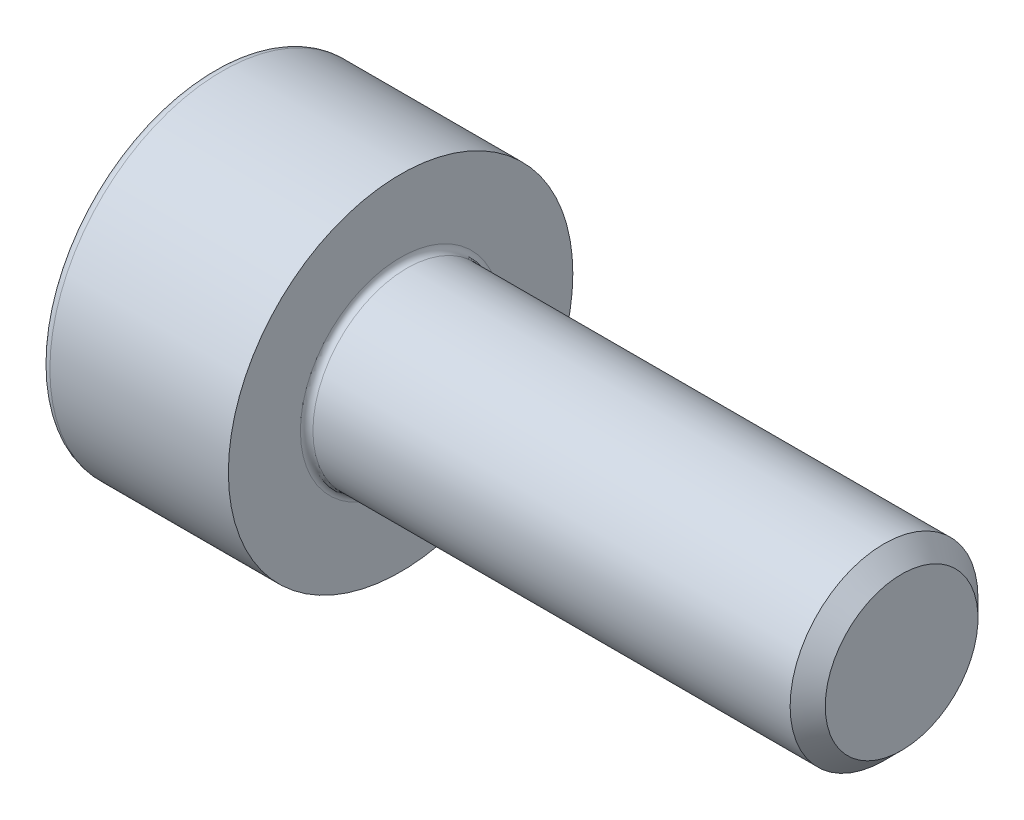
from build123d import *

# Parameters (mm, degrees)
FILLET1_R   = 0.1
FILLET2_R   = 0.15
HEX_2_DEPTH = 1.3


with BuildPart() as part:
    # BodySke → Base-Revolve (revolve)
    with BuildSketch(Plane.XY, mode=Mode.PRIVATE) as base_revolve_sk:
        Polygon((0, 0), (0, 2.75), (3, 2.75), (3, 1.5), (10.7195, 1.5), (11, 1.2195), (11, 0), align=None)
    revolve(base_revolve_sk.sketch.rotate(Axis((-31.75, 0, 0), (1, 0, 0)), 90), axis=Axis((-31.75, 0, 0), (1, 0, 0)))

    # Fillet1
    fillet1_edges = [part.edges().sort_by_distance(p)[0] for p in [
        (3, 0, -1.5),
    ]]
    fillet(fillet1_edges, radius=FILLET1_R)

    # Fillet2
    fillet2_edges = [part.edges().sort_by_distance(p)[0] for p in [
        (0, 0, -2.75),
    ]]
    fillet(fillet2_edges, radius=FILLET2_R)

    # Sketch2 → Hex-PreBroach (revolve, cut)
    with BuildSketch(Plane.XY, mode=Mode.PRIVATE) as hex_prebroach_sk:
        Polygon((0, 1.28), (1.3, 1.28), (2.039008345, 0), (0, 0), align=None)
    revolve(hex_prebroach_sk.sketch.rotate(Axis((0, 0, 0), (1, 0, 0)), 90), axis=Axis((0, 0, 0), (1, 0, 0)), mode=Mode.SUBTRACT)

    # Sketch3 → Hex 2 (cut)
    with BuildSketch(Plane(origin=(0, 0, 0), x_dir=(0, 0.500000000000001, 0.866025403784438), z_dir=(-1, 0, 0))):
        Polygon((0.739008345, 1.28), (-0.739008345, 1.28), (-1.478016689, 0), (-0.739008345, -1.28), (0.739008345, -1.28), (1.478016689, 0), align=None)
    extrude(amount=-HEX_2_DEPTH, mode=Mode.SUBTRACT)


solid = part.part
